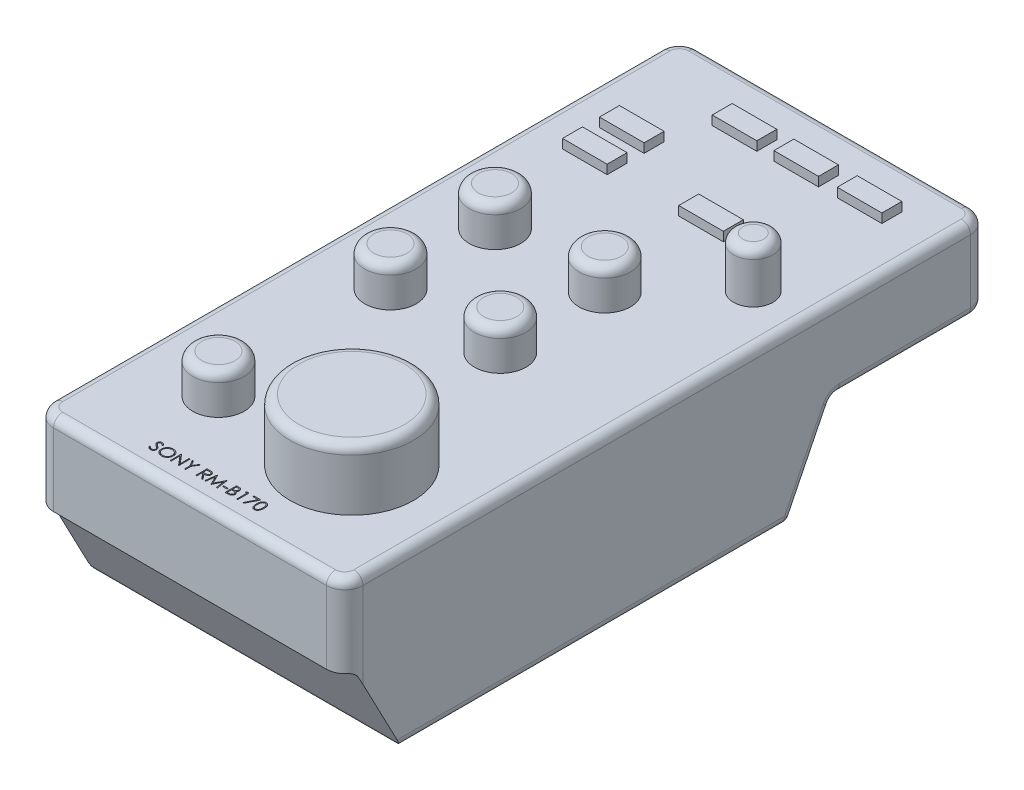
from build123d import *

# Parameters (mm, degrees)
BOSS_EXTRUDE1_DEPTH          = 47
CUT_EXTRUDE1_DEPTH           = 133.722454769
FILLET1_R                    = 2.54
SKETCH3_R                    = 17.1487514
BOSS_EXTRUDE2_DEPTH          = 17
FILLET2_R                    = 2.54
M2_5X0_45_TAPPED_HOLE1_D     = 2.05
M2_5X0_45_TAPPED_HOLE1_DEPTH = 7.2644
M2_5X0_45_TAPPED_HOLE1_TIP   = 0.615882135
SKETCH6_R                    = 7.168230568
BOSS_EXTRUDE3_DEPTH          = 10.922
FILLET3_R                    = 2.54
SKETCH7_R                    = 5.482520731
BOSS_EXTRUDE4_DEPTH          = 13.97
FILLET4_R                    = 2.54
SKETCH8_W                    = 12.400720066
SKETCH8_H                    = 5.547690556
SKETCH8_W_2                  = 12.400720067
BOSS_EXTRUDE5_DEPTH          = 2.54
SKETCH9_W                    = 1.221153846
SKETCH9_H                    = 0.325641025
CUT_EXTRUDE2_DEPTH           = 1.27


with BuildPart() as part:
    # Sketch1 → Boss-Extrude1 (new body)
    with BuildSketch(Plane(origin=(0, 0, 0), x_dir=(1, 0, 0), z_dir=(0, 1, 0))):
        with BuildLine():
            Line((-37.92, 89.5), (37.92, 89.5))
            ThreePointArc((37.92, 89.5), (41.512102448, 88.012102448), (43, 84.42))
            Line((43, 84.42), (43, -84.42))
            ThreePointArc((43, -84.42), (41.512102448, -88.012102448), (37.92, -89.5))
            Line((37.92, -89.5), (-37.92, -89.5))
            ThreePointArc((-37.92, -89.5), (-41.512102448, -88.012102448), (-43, -84.42))
            Line((-43, -84.42), (-43, 84.42))
            ThreePointArc((-43, 84.42), (-41.512102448, 88.012102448), (-37.92, 89.5))
        make_face()
    extrude(amount=BOSS_EXTRUDE1_DEPTH)

    # Sketch2 → Cut-Extrude1 (cut, through all)
    with BuildSketch(Plane(origin=(43, 0, 0), x_dir=(0, 0, -1), z_dir=(1, 0, 0))):
        Polygon((96.291537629, 24.315667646), (46.366008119, 24.315667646), (34.356820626, 0), (34.356820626, -8.083624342), (96.291537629, -8.083624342), align=None)
        Polygon((-100.091843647, 24.315667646), (-86.345531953, 24.315667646), (-73.592412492, 0), (-73.592412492, -10.651398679), (-100.091843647, -10.651398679), align=None)
    extrude(amount=-CUT_EXTRUDE1_DEPTH, mode=Mode.SUBTRACT)

    # Fillet1
    fillet1_edges = [part.edges().sort_by_distance(p)[0] for p in [
        (43, 12.157833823, -40.361414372),
        (-43, 12.157833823, -40.361414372),
        (41.512102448, 47, 88.012102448),
        (0, 47, 89.5),
        (-41.512102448, 47, 88.012102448),
        (-43, 47, 0),
        (-41.512102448, 47, -88.012102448),
        (0, 47, -89.5),
        (41.512102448, 47, -88.012102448),
        (43, 24.315667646, -65.393004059),
        (41.512102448, 24.315667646, -88.012102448),
        (-43, 24.315667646, -65.393004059),
        (-41.512102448, 24.315667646, -88.012102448),
        (43, 47, 0),
        (0, 24.315667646, 86.345531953),
        (-43, 0, 19.617795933),
        (43, 0, 19.617795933),
        (0, 0, 73.592412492),
        (0, 24.315667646, -89.5),
        (0, 24.315667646, -46.366008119),
        (0, 0, -34.356820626),
    ]]
    fillet(fillet1_edges, radius=FILLET1_R)

    # Sketch3 → Boss-Extrude2 (add)
    with BuildSketch(Plane(origin=(0, 47, 0), x_dir=(1, 0, 0), z_dir=(0, 1, 0))):
        with Locations(Location((14.953509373, -59.481737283, 0), (0, 0, 270))):
            Circle(SKETCH3_R)
    extrude(amount=BOSS_EXTRUDE2_DEPTH)

    # Fillet2
    fillet2_edges = [part.edges().sort_by_distance(p)[0] for p in [
        (14.953509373, 64, 42.332985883),
    ]]
    fillet(fillet2_edges, radius=FILLET2_R)

    # M2.5x0.45 Tapped Hole1
    with Locations(Plane(origin=(0, 0, 0), x_dir=(-1, 0, 0), z_dir=(0, -1, 0))):
        with Locations((28, -63.465), (-28, -63.465), (-28, 22.035), (28, 22.035)):
            Hole(M2_5X0_45_TAPPED_HOLE1_D / 2, depth=M2_5X0_45_TAPPED_HOLE1_DEPTH)
            with Locations((0, 0, -(M2_5X0_45_TAPPED_HOLE1_DEPTH + M2_5X0_45_TAPPED_HOLE1_TIP / 2))):  # 118° drill point
                Cone(0, M2_5X0_45_TAPPED_HOLE1_D / 2, M2_5X0_45_TAPPED_HOLE1_TIP, mode=Mode.SUBTRACT)

    # Sketch6 → Boss-Extrude3 (add)
    with BuildSketch(Plane(origin=(0, 47, 0), x_dir=(1, 0, 0), z_dir=(0, 1, 0))):
        with Locations(Location((-20.069586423, -61.514098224, 0), (0, 0, 270))):
            Circle(SKETCH6_R)
        with Locations(Location((-22.027594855, -11.748050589, 0), (0, 0, 270))):
            Circle(SKETCH6_R)
        with Locations(Location((8.484703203, -11.748050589, 0), (0, 0, 270))):
            Circle(SKETCH6_R)
        with Locations(Location((8.484703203, 17.295741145, 0), (0, 0, 270))):
            Circle(SKETCH6_R)
        with Locations(Location((-22.027594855, 17.295741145, 0), (0, 0, 270))):
            Circle(SKETCH6_R)
    extrude(amount=BOSS_EXTRUDE3_DEPTH)

    # Fillet3
    fillet3_edges = [part.edges().sort_by_distance(p)[0] for p in [
        (-20.069586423, 57.922, 54.345867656),
        (-22.027594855, 57.922, 4.579820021),
        (8.484703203, 57.922, 4.579820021),
        (8.484703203, 57.922, -24.463971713),
        (-22.027594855, 57.922, -24.463971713),
    ]]
    fillet(fillet3_edges, radius=FILLET3_R)

    # Sketch7 → Boss-Extrude4 (add)
    with BuildSketch(Plane(origin=(0, 47, 0), x_dir=(1, 0, 0), z_dir=(0, 1, 0))):
        with Locations(Location((28.880624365, 38.181164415, 0), (0, 0, 270))):
            Circle(SKETCH7_R)
    extrude(amount=BOSS_EXTRUDE4_DEPTH)

    # Fillet4
    fillet4_edges = [part.edges().sort_by_distance(p)[0] for p in [
        (28.880624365, 60.97, -43.663685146),
    ]]
    fillet(fillet4_edges, radius=FILLET4_R)

    # Sketch8 → Boss-Extrude5 (add)
    with BuildSketch(Plane(origin=(0, 47, 0), x_dir=(1, 0, 0), z_dir=(0, 1, 0))):
        with Locations((24.311938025, 75.056989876)):
            Rectangle(SKETCH8_W, SKETCH8_H)
        with Locations((6.689862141, 75.056989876)):
            Rectangle(SKETCH8_W, SKETCH8_H)
        with Locations((-10.442711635, 75.056989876)):
            Rectangle(SKETCH8_W, SKETCH8_H)
        with Locations((-25.61727698, 58.903420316)):
            Rectangle(SKETCH8_W_2, SKETCH8_H)
        with Locations((-25.61727698, 48.62387605)):
            Rectangle(SKETCH8_W_2, SKETCH8_H)
        with Locations((6.689862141, 48.62387605)):
            Rectangle(SKETCH8_W, SKETCH8_H)
    extrude(amount=BOSS_EXTRUDE5_DEPTH)

    # Sketch9 → Cut-Extrude2 (cut)
    # profile 1 of 11: a face of its own
    with BuildSketch(Plane(origin=(0, 47, 0), x_dir=(1, 0, 0), z_dir=(0, 1, 0))):
        with BuildLine():
            Line((-17.703832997, -83.092375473), (-17.435433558, -82.931463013))
            add(Edge.make_bspline(
                [(-17.435433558, -82.931463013), (-17.410470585, -82.97324999), (-17.362642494, -83.053312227), (-17.282858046, -83.161496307), (-17.200187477, -83.253446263), (-17.114018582, -83.328627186), (-17.024877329, -83.387817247), (-16.932181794, -83.429729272), (-16.836244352, -83.455869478), (-16.770953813, -83.459044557), (-16.738358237, -83.460629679)],
                knots=[0, 0, 0, 0, 1.272034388, 2.437168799, 3.508375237, 4.49857839, 5.41946034, 6.295179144, 7.148887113, 8, 8, 8, 8], degree=3))
            add(Edge.make_bspline(
                [(-16.738358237, -83.460629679), (-16.710520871, -83.459854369), (-16.655333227, -83.458317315), (-16.574087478, -83.443548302), (-16.495182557, -83.420858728), (-16.420244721, -83.388364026), (-16.350307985, -83.349049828), (-16.288979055, -83.301564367), (-16.235960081, -83.248400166), (-16.192590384, -83.189088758), (-16.159316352, -83.125301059), (-16.133742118, -83.05982716), (-16.119549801, -82.99163853), (-16.117411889, -82.94572761), (-16.116332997, -82.922558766)],
                knots=[0, 0, 0, 0, 1.095163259, 2.171163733, 3.241058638, 4.321873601, 5.38011039, 6.391990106, 7.366004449, 8.327778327, 9.272591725, 10.192022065, 11.087607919, 12, 12, 12, 12], degree=3))
            add(Edge.make_bspline(
                [(-16.116332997, -82.922558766), (-16.117670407, -82.896123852), (-16.120389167, -82.842385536), (-16.143368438, -82.763101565), (-16.179517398, -82.684640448), (-16.212866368, -82.636107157), (-16.230180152, -82.610910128)],
                knots=[0, 0, 0, 0, 0.938893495, 1.908633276, 2.914225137, 4, 4, 4, 4], degree=3))
            add(Edge.make_bspline(
                [(-16.230180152, -82.610910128), (-16.244395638, -82.592724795), (-16.274239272, -82.554546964), (-16.325545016, -82.497718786), (-16.385748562, -82.439100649), (-16.452789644, -82.376454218), (-16.529110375, -82.312693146), (-16.612320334, -82.244776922), (-16.704543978, -82.175288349), (-16.769222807, -82.128686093), (-16.802596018, -82.104640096)],
                knots=[0, 0, 0, 0, 0.722233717, 1.516239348, 2.393582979, 3.351407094, 4.387010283, 5.505090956, 6.712668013, 8, 8, 8, 8], degree=3))
            add(Edge.make_bspline(
                [(-16.802596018, -82.104640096), (-16.836000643, -82.08084702), (-16.899867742, -82.035356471), (-16.989183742, -81.967843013), (-17.069052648, -81.906117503), (-17.13911947, -81.849598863), (-17.19935339, -81.798279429), (-17.250229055, -81.752652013), (-17.290450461, -81.71148264), (-17.312816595, -81.684775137), (-17.322858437, -81.672784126)],
                knots=[0, 0, 0, 0, 1.452282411, 2.77665338, 3.964542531, 5.026858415, 5.96415736, 6.766646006, 7.446254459, 8, 8, 8, 8], degree=3))
            add(Edge.make_bspline(
                [(-17.322858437, -81.672784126), (-17.336894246, -81.654096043), (-17.364497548, -81.617343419), (-17.400933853, -81.559898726), (-17.431902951, -81.501094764), (-17.456180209, -81.440773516), (-17.476623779, -81.37978183), (-17.490374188, -81.317323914), (-17.498984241, -81.253680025), (-17.499865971, -81.210850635), (-17.500307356, -81.189410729)],
                knots=[0, 0, 0, 0, 1.068054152, 2.10047183, 3.106115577, 4.101338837, 5.06977816, 6.043150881, 7.020423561, 8, 8, 8, 8], degree=3))
            add(Edge.make_bspline(
                [(-17.500307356, -81.189410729), (-17.499123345, -81.155819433), (-17.49678063, -81.089354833), (-17.476968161, -80.992262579), (-17.445696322, -80.899564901), (-17.401885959, -80.812179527), (-17.345409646, -80.732381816), (-17.280053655, -80.659253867), (-17.202210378, -80.597778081), (-17.116800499, -80.544064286), (-17.023313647, -80.502021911), (-16.92535047, -80.470307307), (-16.822755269, -80.452337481), (-16.753265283, -80.449758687), (-16.718005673, -80.448450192)],
                knots=[0, 0, 0, 0, 1.005424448, 1.989358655, 2.955360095, 3.929531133, 4.905563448, 5.876582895, 6.856512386, 7.866279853, 8.892233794, 9.918561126, 10.94386622, 12, 12, 12, 12], degree=3))
            add(Edge.make_bspline(
                [(-16.718005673, -80.448450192), (-16.680591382, -80.44974065), (-16.606186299, -80.452306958), (-16.496740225, -80.474620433), (-16.39136586, -80.511541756), (-16.30659947, -80.553441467), (-16.240257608, -80.595289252), (-16.189663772, -80.633407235), (-16.13839437, -80.677290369), (-16.086035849, -80.727055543), (-16.033475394, -80.783159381), (-15.979932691, -80.845217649), (-15.925282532, -80.912851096), (-15.890125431, -80.961133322), (-15.872102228, -80.985885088)],
                knots=[0, 0, 0, 0, 1.286793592, 2.559021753, 3.825965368, 5.121522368, 5.803751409, 6.523245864, 7.299691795, 8.125521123, 9.008227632, 9.944561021, 10.946284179, 12, 12, 12, 12], degree=3))
            Line((-15.872102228, -80.985885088), (-16.129689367, -81.1811425))
            add(Edge.make_bspline(
                [(-16.129689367, -81.1811425), (-16.145243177, -81.161104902), (-16.175196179, -81.122517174), (-16.220670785, -81.06847748), (-16.263532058, -81.01911396), (-16.305759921, -80.976237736), (-16.345124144, -80.937500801), (-16.383330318, -80.904335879), (-16.419828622, -80.876418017), (-16.465836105, -80.846624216), (-16.523637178, -80.817090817), (-16.596194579, -80.792099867), (-16.672019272, -80.777082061), (-16.72366258, -80.775096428), (-16.749806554, -80.774091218)],
                knots=[0, 0, 0, 0, 1.181633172, 2.275549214, 3.290209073, 4.226197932, 5.078386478, 5.862611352, 6.581680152, 7.217281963, 8.414376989, 9.595101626, 10.782541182, 12, 12, 12, 12], degree=3))
            add(Edge.make_bspline(
                [(-16.749806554, -80.774091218), (-16.782605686, -80.775190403), (-16.84585572, -80.777310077), (-16.935654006, -80.80046035), (-17.016474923, -80.836911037), (-17.085919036, -80.887996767), (-17.143737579, -80.948522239), (-17.185561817, -81.018171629), (-17.210735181, -81.09508138), (-17.21380702, -81.148731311), (-17.215371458, -81.176054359)],
                knots=[0, 0, 0, 0, 1.14458467, 2.207223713, 3.21896685, 4.227309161, 5.202851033, 6.127160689, 7.046193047, 8, 8, 8, 8], degree=3))
            add(Edge.make_bspline(
                [(-17.215371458, -81.176054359), (-17.215014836, -81.193064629), (-17.214301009, -81.227112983), (-17.2043453, -81.277415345), (-17.191555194, -81.327590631), (-17.171287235, -81.37741326), (-17.143306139, -81.427754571), (-17.106562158, -81.479481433), (-17.060285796, -81.533049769), (-17.024837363, -81.567890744), (-17.006121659, -81.586285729)],
                knots=[0, 0, 0, 0, 0.858281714, 1.717966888, 2.583508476, 3.4729293, 4.427298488, 5.488583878, 6.674047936, 8, 8, 8, 8], degree=3))
            add(Edge.make_bspline(
                [(-17.006121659, -81.586285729), (-16.999171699, -81.592487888), (-16.982660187, -81.607222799), (-16.952474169, -81.631345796), (-16.912611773, -81.661102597), (-16.864113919, -81.697921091), (-16.806086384, -81.740630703), (-16.738522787, -81.788685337), (-16.662176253, -81.843645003), (-16.607999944, -81.882069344), (-16.57935383, -81.90238649)],
                knots=[0, 0, 0, 0, 0.420754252, 0.999615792, 1.744751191, 2.668019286, 3.750313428, 4.999500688, 6.413464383, 8, 8, 8, 8], degree=3))
            add(Edge.make_bspline(
                [(-16.57935383, -81.90238649), (-16.54489518, -81.927461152), (-16.47817078, -81.97601476), (-16.383231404, -82.048963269), (-16.297149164, -82.120308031), (-16.21962183, -82.189593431), (-16.149883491, -82.256293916), (-16.088707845, -82.321211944), (-16.035471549, -82.383882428), (-15.978158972, -82.464230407), (-15.919595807, -82.56291039), (-15.86930244, -82.683812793), (-15.837590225, -82.805185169), (-15.833443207, -82.886761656), (-15.831397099, -82.927010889)],
                knots=[0, 0, 0, 0, 1.163667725, 2.253281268, 3.268753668, 4.215851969, 5.092017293, 5.902905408, 6.650798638, 7.335211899, 8.59617414, 9.77448103, 10.901945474, 12, 12, 12, 12], degree=3))
            add(Edge.make_bspline(
                [(-15.831397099, -82.927010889), (-15.831993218, -82.955475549), (-15.833173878, -83.011852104), (-15.846745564, -83.094633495), (-15.866629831, -83.175034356), (-15.896599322, -83.252060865), (-15.933178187, -83.327122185), (-15.979593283, -83.398249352), (-16.033393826, -83.467016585), (-16.09511017, -83.531590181), (-16.162643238, -83.590868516), (-16.23402059, -83.643599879), (-16.309359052, -83.687567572), (-16.388249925, -83.723445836), (-16.47071133, -83.751506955), (-16.556715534, -83.771838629), (-16.646404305, -83.784317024), (-16.707364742, -83.785612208), (-16.738358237, -83.786270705)],
                knots=[0, 0, 0, 0, 0.983748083, 1.948392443, 2.894712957, 3.844097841, 4.80183111, 5.778335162, 6.776009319, 7.81870978, 8.863265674, 9.881300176, 10.883814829, 11.87499822, 12.874611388, 13.892143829, 14.928324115, 16, 16, 16, 16], degree=3))
            add(Edge.make_bspline(
                [(-16.738358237, -83.786270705), (-16.76233887, -83.78580699), (-16.809998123, -83.784885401), (-16.880491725, -83.776738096), (-16.949561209, -83.765210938), (-17.01633988, -83.746910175), (-17.081688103, -83.72470606), (-17.145321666, -83.697366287), (-17.207271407, -83.664602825), (-17.2678845, -83.627142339), (-17.327006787, -83.583547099), (-17.384083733, -83.532771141), (-17.440988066, -83.476214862), (-17.496040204, -83.412342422), (-17.550353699, -83.342185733), (-17.602857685, -83.265088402), (-17.654638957, -83.181470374), (-17.687128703, -83.122628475), (-17.703832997, -83.092375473)],
                knots=[0, 0, 0, 0, 0.915332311, 1.819136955, 2.706846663, 3.586547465, 4.459518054, 5.340707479, 6.227863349, 7.133153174, 8.059268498, 9.028702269, 10.047606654, 11.120612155, 12.245963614, 13.433783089, 14.680604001, 16, 16, 16, 16], degree=3))
        make_face()
    # profile 2 of 11: a face of its own
    with BuildSketch(Plane(origin=(0, 47, 0), x_dir=(1, 0, 0), z_dir=(0, 1, 0))):
        with BuildLine():
            add(Edge.make_bspline(
                [(-13.694377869, -80.448450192), (-13.635587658, -80.449939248), (-13.520118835, -80.452863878), (-13.350415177, -80.47525135), (-13.188403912, -80.513982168), (-13.032765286, -80.565565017), (-12.885360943, -80.634375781), (-12.745081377, -80.717547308), (-12.612260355, -80.815950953), (-12.488688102, -80.928826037), (-12.37560644, -81.05163817), (-12.275978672, -81.182700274), (-12.192483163, -81.321219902), (-12.123916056, -81.466780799), (-12.070123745, -81.61905377), (-12.033004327, -81.778850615), (-12.009293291, -81.94513597), (-12.006521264, -82.058553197), (-12.005115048, -82.116088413)],
                knots=[0, 0, 0, 0, 1.065120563, 2.091984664, 3.0946048, 4.079830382, 5.057816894, 6.036188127, 7.030412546, 8.04752943, 9.064399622, 10.05169764, 11.02544977, 11.989514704, 12.962713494, 13.945757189, 14.957906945, 16, 16, 16, 16], degree=3))
            add(Edge.make_bspline(
                [(-12.005115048, -82.116088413), (-12.006521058, -82.173199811), (-12.009292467, -82.285772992), (-12.033031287, -82.451003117), (-12.070261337, -82.609835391), (-12.123416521, -82.762004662), (-12.191656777, -82.907671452), (-12.275708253, -83.046452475), (-12.374714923, -83.178393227), (-12.487388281, -83.302048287), (-12.610216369, -83.41543885), (-12.741960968, -83.51424383), (-12.879659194, -83.599265), (-13.025083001, -83.667104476), (-13.176303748, -83.721326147), (-13.334674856, -83.758294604), (-13.49945423, -83.782140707), (-13.611822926, -83.784878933), (-13.668937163, -83.786270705)],
                knots=[0, 0, 0, 0, 1.043624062, 2.057103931, 3.04512605, 4.022047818, 4.998200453, 5.980619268, 6.982898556, 8.009068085, 9.034988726, 10.034168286, 11.015286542, 11.987931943, 12.962482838, 13.94673481, 14.956375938, 16, 16, 16, 16], degree=3))
            add(Edge.make_bspline(
                [(-13.668937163, -83.786270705), (-13.726472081, -83.78486519), (-13.83988872, -83.782094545), (-14.006383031, -83.758344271), (-14.166292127, -83.721204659), (-14.319158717, -83.668128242), (-14.465068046, -83.599532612), (-14.604305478, -83.515890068), (-14.736312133, -83.416642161), (-14.859993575, -83.30400534), (-14.973158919, -83.181385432), (-15.07181921, -83.050000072), (-15.155480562, -82.912426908), (-15.223845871, -82.768284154), (-15.277970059, -82.618268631), (-15.314895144, -82.461379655), (-15.338785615, -82.298511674), (-15.341538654, -82.187619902), (-15.342935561, -82.131352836)],
                knots=[0, 0, 0, 0, 1.053102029, 2.075944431, 3.073151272, 4.055350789, 5.033113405, 6.020478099, 7.024410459, 8.052272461, 9.079885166, 10.07527673, 11.055994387, 12.023226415, 12.992069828, 13.970394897, 14.97016774, 16, 16, 16, 16], degree=3))
            add(Edge.make_bspline(
                [(-15.342935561, -82.131352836), (-15.34245057, -82.093586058), (-15.341486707, -82.018528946), (-15.329882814, -81.907071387), (-15.3130447, -81.79740629), (-15.288912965, -81.689845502), (-15.257351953, -81.584652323), (-15.220111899, -81.481101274), (-15.174627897, -81.380241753), (-15.123210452, -81.281595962), (-15.065822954, -81.186701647), (-15.002435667, -81.09700374), (-14.935275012, -81.01174955), (-14.861648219, -80.933148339), (-14.783981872, -80.858913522), (-14.701016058, -80.790185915), (-14.613257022, -80.726345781), (-14.520327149, -80.668814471), (-14.424516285, -80.616781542), (-14.325749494, -80.572130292), (-14.225368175, -80.533807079), (-14.122902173, -80.502745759), (-14.018623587, -80.47822384), (-13.912304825, -80.461525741), (-13.804030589, -80.449892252), (-13.731086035, -80.448932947), (-13.694377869, -80.448450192)],
                knots=[0, 0, 0, 0, 1.037015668, 2.060948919, 3.074880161, 4.083647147, 5.086022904, 6.090072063, 7.104153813, 8.122640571, 9.144368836, 10.147691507, 11.138137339, 12.123020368, 13.103399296, 14.087645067, 15.080126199, 16.082011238, 17.087798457, 18.072939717, 19.057185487, 20.037253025, 21.01195951, 21.997135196, 22.992090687, 24, 24, 24, 24], degree=3))
        make_face()
        with BuildLine():
            add(Edge.make_bspline(
                [(-13.680385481, -80.774091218), (-13.710515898, -80.774458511), (-13.770488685, -80.775189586), (-13.8596468, -80.784819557), (-13.94763234, -80.798544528), (-14.034463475, -80.81812205), (-14.119776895, -80.844795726), (-14.204367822, -80.875494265), (-14.287464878, -80.912887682), (-14.368793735, -80.955135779), (-14.447638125, -81.001898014), (-14.522035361, -81.053579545), (-14.592178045, -81.108968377), (-14.657894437, -81.168193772), (-14.718991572, -81.231557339), (-14.77667198, -81.298098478), (-14.828623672, -81.369719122), (-14.876235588, -81.444477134), (-14.918842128, -81.52227514), (-14.956729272, -81.602294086), (-14.987720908, -81.685186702), (-15.012996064, -81.770053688), (-15.033950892, -81.856760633), (-15.047225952, -81.945965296), (-15.056961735, -82.037219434), (-15.057651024, -82.098888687), (-15.057999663, -82.130080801)],
                knots=[0, 0, 0, 0, 1.008559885, 2.007477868, 2.99961109, 3.989939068, 4.984837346, 5.991145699, 7.001802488, 8.033829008, 9.059044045, 10.069351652, 11.065060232, 12.050310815, 13.029377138, 14.011219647, 14.996725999, 15.989392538, 16.977580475, 17.965360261, 18.951710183, 19.937753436, 20.929683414, 21.935841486, 22.955955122, 24, 24, 24, 24], degree=3))
            add(Edge.make_bspline(
                [(-15.057999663, -82.130080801), (-15.056843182, -82.175947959), (-15.054568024, -82.266182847), (-15.034649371, -82.398415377), (-15.003968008, -82.525495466), (-14.958740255, -82.646727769), (-14.90217934, -82.763154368), (-14.832304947, -82.873742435), (-14.749519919, -82.978521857), (-14.655482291, -83.076761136), (-14.552682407, -83.166428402), (-14.443523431, -83.245135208), (-14.329174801, -83.311728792), (-14.209338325, -83.365980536), (-14.084653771, -83.408969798), (-13.954317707, -83.438432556), (-13.819198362, -83.457823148), (-13.727095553, -83.459685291), (-13.680385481, -83.460629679)],
                knots=[0, 0, 0, 0, 1.032063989, 2.030389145, 3.003944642, 3.970395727, 4.937377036, 5.913328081, 6.909231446, 7.93887556, 8.970685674, 9.976071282, 10.964166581, 11.944589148, 12.933237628, 13.927779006, 14.949070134, 16, 16, 16, 16], degree=3))
            add(Edge.make_bspline(
                [(-13.680385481, -83.460629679), (-13.648989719, -83.460198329), (-13.586722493, -83.459342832), (-13.494107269, -83.450726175), (-13.403160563, -83.436908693), (-13.314009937, -83.417014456), (-13.226756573, -83.392115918), (-13.141036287, -83.362536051), (-13.057762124, -83.325632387), (-12.975883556, -83.284858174), (-12.897509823, -83.238376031), (-12.822692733, -83.188448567), (-12.753318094, -83.133141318), (-12.687650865, -83.074795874), (-12.62630289, -83.012235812), (-12.569689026, -82.945542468), (-12.517999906, -82.874294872), (-12.470406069, -82.799650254), (-12.427948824, -82.721639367), (-12.390956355, -82.641330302), (-12.359572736, -82.55892081), (-12.334237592, -82.474292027), (-12.314384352, -82.387604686), (-12.30070471, -82.298742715), (-12.29113577, -82.207883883), (-12.290414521, -82.146430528), (-12.290050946, -82.115452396)],
                knots=[0, 0, 0, 0, 1.047197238, 2.076906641, 3.100256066, 4.114471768, 5.12198147, 6.126382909, 7.136867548, 8.15857795, 9.17633901, 10.174870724, 11.156907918, 12.133735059, 13.104061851, 14.077631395, 15.04955518, 16.038496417, 17.029181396, 18.010275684, 18.986308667, 19.968651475, 20.955262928, 21.950658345, 22.966943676, 24, 24, 24, 24], degree=3))
            add(Edge.make_bspline(
                [(-12.290050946, -82.115452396), (-12.290414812, -82.084686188), (-12.291136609, -82.023655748), (-12.30070014, -81.933430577), (-12.314398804, -81.845208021), (-12.33414069, -81.759334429), (-12.359586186, -81.675787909), (-12.390961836, -81.594646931), (-12.427959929, -81.515609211), (-12.470421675, -81.438870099), (-12.518151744, -81.365233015), (-12.570307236, -81.294836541), (-12.627788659, -81.229002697), (-12.688953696, -81.166106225), (-12.755330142, -81.107488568), (-12.826617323, -81.053130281), (-12.901949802, -81.001719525), (-12.981712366, -80.955341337), (-13.064030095, -80.912511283), (-13.148497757, -80.875816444), (-13.23415844, -80.844636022), (-13.320794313, -80.818041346), (-13.409134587, -80.798621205), (-13.498582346, -80.784807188), (-13.589013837, -80.775192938), (-13.649831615, -80.774459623), (-13.680385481, -80.774091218)],
                knots=[0, 0, 0, 0, 1.02996197, 2.043119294, 3.035359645, 4.018872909, 4.991431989, 5.957985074, 6.929999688, 7.912076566, 8.892894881, 9.867085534, 10.843653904, 11.817741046, 12.803660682, 13.806313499, 14.818574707, 15.856120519, 16.894564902, 17.924820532, 18.937903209, 19.946497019, 20.957711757, 21.963978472, 22.977135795, 24, 24, 24, 24], degree=3))
        make_face(mode=Mode.SUBTRACT)
    # profile 3 of 11: a face of its own
    with BuildSketch(Plane(origin=(0, 47, 0), x_dir=(1, 0, 0), z_dir=(0, 1, 0))):
        Polygon((-11.353832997, -83.704860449), (-11.353832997, -80.529860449), (-11.29404734, -80.529860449), (-9.196461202, -83.02877371), (-9.196461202, -80.529860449), (-8.911525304, -80.529860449), (-8.911525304, -83.704860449), (-8.976399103, -83.704860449), (-11.068897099, -81.211671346), (-11.068897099, -83.704860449), align=None)
    # profile 4 of 11: a face of its own
    with BuildSketch(Plane(origin=(0, 47, 0), x_dir=(1, 0, 0), z_dir=(0, 1, 0))):
        Polygon((-8.34165351, -80.529860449), (-8.015376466, -80.529860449), (-7.180921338, -81.894118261), (-6.347738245, -80.529860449), (-6.021461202, -80.529860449), (-7.039089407, -82.195590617), (-7.039089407, -83.704860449), (-7.324025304, -83.704860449), (-7.324025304, -82.195590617), align=None)
    # profile 5 of 11: a face of its own
    with BuildSketch(Plane(origin=(0, 47, 0), x_dir=(1, 0, 0), z_dir=(0, 1, 0))):
        with BuildLine():
            Line((-4.230435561, -80.529860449), (-3.59505395, -80.529860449))
            add(Edge.make_bspline(
                [(-3.59505395, -80.529860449), (-3.552653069, -80.530001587), (-3.471238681, -80.530272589), (-3.354604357, -80.531783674), (-3.248625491, -80.536114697), (-3.153357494, -80.539841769), (-3.068802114, -80.54663803), (-2.994700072, -80.55313376), (-2.93139266, -80.561637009), (-2.893069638, -80.569534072), (-2.875718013, -80.573109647)],
                knots=[0, 0, 0, 0, 1.410062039, 2.707475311, 3.878576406, 4.937260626, 5.877586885, 6.699081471, 7.410979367, 8, 8, 8, 8], degree=3))
            add(Edge.make_bspline(
                [(-2.875718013, -80.573109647), (-2.852489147, -80.578848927), (-2.806526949, -80.590205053), (-2.740350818, -80.614207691), (-2.677291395, -80.641984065), (-2.617610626, -80.674608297), (-2.561607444, -80.712322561), (-2.508704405, -80.754475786), (-2.458661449, -80.800837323), (-2.413502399, -80.852576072), (-2.370921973, -80.906856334), (-2.335009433, -80.965551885), (-2.304051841, -81.026930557), (-2.279404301, -81.091616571), (-2.259557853, -81.158982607), (-2.24556405, -81.229638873), (-2.237171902, -81.303263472), (-2.236317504, -81.353481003), (-2.235884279, -81.378943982)],
                knots=[0, 0, 0, 0, 1.027469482, 2.033020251, 3.019912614, 3.986113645, 4.951240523, 5.91722682, 6.890402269, 7.87763091, 8.8651537, 9.85103654, 10.82876324, 11.815024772, 12.821070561, 13.842952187, 14.906261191, 16, 16, 16, 16], degree=3))
            add(Edge.make_bspline(
                [(-2.235884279, -81.378943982), (-2.23721687, -81.421248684), (-2.2398171, -81.503796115), (-2.264060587, -81.6235942), (-2.303772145, -81.735344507), (-2.358493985, -81.838906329), (-2.428180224, -81.932260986), (-2.511931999, -82.014258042), (-2.609796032, -82.082874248), (-2.700899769, -82.130456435), (-2.781376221, -82.160930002), (-2.847627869, -82.182371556), (-2.919897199, -82.198937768), (-2.997491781, -82.213778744), (-3.080734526, -82.224983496), (-3.169425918, -82.233190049), (-3.263629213, -82.238319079), (-3.32834394, -82.239082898), (-3.361635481, -82.239475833)],
                knots=[0, 0, 0, 0, 1.260483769, 2.459530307, 3.627416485, 4.787058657, 5.939039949, 7.08810263, 8.267026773, 9.491475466, 10.141966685, 10.831826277, 11.566392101, 12.351337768, 13.187381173, 14.07005841, 15.007169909, 16, 16, 16, 16], degree=3))
            Line((-3.361635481, -82.239475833), (-2.195179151, -83.704860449))
            Line((-2.195179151, -83.704860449), (-2.547532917, -83.704860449))
            Line((-2.547532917, -83.704860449), (-3.713989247, -82.239475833))
            Line((-3.713989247, -82.239475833), (-3.945499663, -82.239475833))
            Line((-3.945499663, -82.239475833), (-3.945499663, -83.704860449))
            Line((-3.945499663, -83.704860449), (-4.230435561, -83.704860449))
            Line((-4.230435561, -83.704860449), (-4.230435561, -80.529860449))
        make_face()
        with BuildLine():
            Line((-3.945499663, -80.855501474), (-3.945499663, -81.913834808))
            Line((-3.945499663, -81.913834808), (-3.364179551, -81.918286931))
            add(Edge.make_bspline(
                [(-3.364179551, -81.918286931), (-3.337037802, -81.918298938), (-3.284429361, -81.918322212), (-3.208319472, -81.914699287), (-3.13745337, -81.910577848), (-3.072102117, -81.904273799), (-3.012236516, -81.896149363), (-2.957886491, -81.885986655), (-2.908963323, -81.87414657), (-2.851905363, -81.855820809), (-2.788190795, -81.826786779), (-2.718947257, -81.784545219), (-2.65998085, -81.731414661), (-2.610162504, -81.670660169), (-2.570130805, -81.603861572), (-2.541907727, -81.531819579), (-2.523998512, -81.456352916), (-2.521886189, -81.404484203), (-2.520820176, -81.378307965)],
                knots=[0, 0, 0, 0, 1.146690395, 2.22261258, 3.21895312, 4.145990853, 4.996080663, 5.770904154, 6.481378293, 7.121626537, 8.300444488, 9.431385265, 10.535395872, 11.636531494, 12.74115979, 13.810798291, 14.895190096, 16, 16, 16, 16], degree=3))
            add(Edge.make_bspline(
                [(-2.520820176, -81.378307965), (-2.521910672, -81.352775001), (-2.524071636, -81.302177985), (-2.541714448, -81.228104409), (-2.571549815, -81.158193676), (-2.611756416, -81.092730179), (-2.660741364, -81.033307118), (-2.718179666, -80.982464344), (-2.782500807, -80.940509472), (-2.842618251, -80.913699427), (-2.896352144, -80.897262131), (-2.943006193, -80.885695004), (-2.995721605, -80.876401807), (-3.054754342, -80.868955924), (-3.119852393, -80.862556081), (-3.191344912, -80.858245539), (-3.268757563, -80.855692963), (-3.322412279, -80.855566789), (-3.350187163, -80.855501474)],
                knots=[0, 0, 0, 0, 1.101028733, 2.181837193, 3.264309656, 4.369019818, 5.486613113, 6.575447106, 7.666700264, 8.788928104, 9.402425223, 10.0903467, 10.862060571, 11.710948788, 12.657782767, 13.684531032, 14.801375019, 16, 16, 16, 16], degree=3))
            Line((-3.350187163, -80.855501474), (-3.945499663, -80.855501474))
        make_face(mode=Mode.SUBTRACT)
    # profile 6 of 11: a face of its own
    with BuildSketch(Plane(origin=(0, 47, 0), x_dir=(1, 0, 0), z_dir=(0, 1, 0))):
        Polygon((-1.706717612, -83.704860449), (-1.287581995, -80.529860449), (-1.246876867, -80.529860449), (0.063955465, -83.134988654), (1.371607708, -80.529860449), (1.412948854, -80.529860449), (1.834628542, -83.704860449), (1.548420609, -83.704860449), (1.244404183, -81.420285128), (0.098300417, -83.704860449), (0.034062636, -83.704860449), (-1.116493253, -81.415196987), (-1.419873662, -83.704860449), align=None)
    # profile 7 of 11: a face of its own
    with BuildSketch(Plane(origin=(0, 47, 0), x_dir=(1, 0, 0), z_dir=(0, 1, 0))):
        with Locations((2.811551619, -82.483706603)):
            Rectangle(SKETCH9_W, SKETCH9_H)
    # profile 8 of 11: a face of its own
    with BuildSketch(Plane(origin=(0, 47, 0), x_dir=(1, 0, 0), z_dir=(0, 1, 0))):
        with BuildLine():
            Line((3.951295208, -80.529860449), (4.570776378, -80.529860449))
            add(Edge.make_bspline(
                [(4.570776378, -80.529860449), (4.601100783, -80.530019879), (4.659877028, -80.530328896), (4.745347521, -80.53512145), (4.8254018, -80.541656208), (4.900063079, -80.552024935), (4.969296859, -80.564536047), (5.033311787, -80.57968698), (5.0919043, -80.59785398), (5.161856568, -80.626743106), (5.241613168, -80.66967198), (5.32797171, -80.733107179), (5.401816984, -80.810697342), (5.465486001, -80.898220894), (5.516105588, -80.994501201), (5.552726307, -81.097243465), (5.575910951, -81.205122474), (5.578295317, -81.279184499), (5.579500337, -81.316614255)],
                knots=[0, 0, 0, 0, 1.001505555, 1.941167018, 2.826882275, 3.653841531, 4.429895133, 5.150066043, 5.825578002, 6.45369114, 7.647487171, 8.808567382, 9.977351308, 11.170798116, 12.373658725, 13.556498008, 14.765093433, 16, 16, 16, 16], degree=3))
            add(Edge.make_bspline(
                [(5.579500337, -81.316614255), (5.578508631, -81.351677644), (5.576559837, -81.420580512), (5.557924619, -81.52135874), (5.528750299, -81.617290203), (5.488196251, -81.708024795), (5.43548944, -81.79151243), (5.373025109, -81.868426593), (5.297662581, -81.935510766), (5.24119907, -81.973014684), (5.212518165, -81.992064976)],
                knots=[0, 0, 0, 0, 1.044552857, 2.05264487, 3.044412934, 4.028983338, 5.005914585, 5.980388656, 6.974128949, 8, 8, 8, 8], degree=3))
            add(Edge.make_bspline(
                [(5.212518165, -81.992064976), (5.248586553, -82.005912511), (5.317594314, -82.032406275), (5.412559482, -82.079247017), (5.494379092, -82.130194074), (5.563682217, -82.185830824), (5.622952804, -82.24580096), (5.674707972, -82.310983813), (5.718868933, -82.382229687), (5.756708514, -82.458795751), (5.786234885, -82.53990019), (5.808347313, -82.624782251), (5.821017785, -82.713137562), (5.822820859, -82.77326787), (5.823731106, -82.803623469)],
                knots=[0, 0, 0, 0, 1.27268992, 2.434971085, 3.483601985, 4.442670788, 5.356604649, 6.2567628, 7.179492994, 8.113709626, 9.066344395, 10.018646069, 10.999752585, 12, 12, 12, 12], degree=3))
            add(Edge.make_bspline(
                [(5.823731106, -82.803623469), (5.822844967, -82.834617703), (5.821101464, -82.895599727), (5.808238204, -82.985184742), (5.786458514, -83.070796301), (5.75645826, -83.152988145), (5.717303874, -83.231601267), (5.669653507, -83.306724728), (5.612837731, -83.377603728), (5.5492807, -83.445025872), (5.477378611, -83.505648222), (5.399803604, -83.55963747), (5.315578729, -83.60403854), (5.226087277, -83.641336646), (5.130325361, -83.669827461), (5.028722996, -83.689759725), (4.921367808, -83.703190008), (4.847698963, -83.704294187), (4.809919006, -83.704860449)],
                knots=[0, 0, 0, 0, 0.978564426, 1.925352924, 2.850884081, 3.763762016, 4.682927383, 5.618979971, 6.567305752, 7.547517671, 8.540179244, 9.531824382, 10.526200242, 11.540722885, 12.589160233, 13.674978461, 14.80764778, 16, 16, 16, 16], degree=3))
            Line((4.809919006, -83.704860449), (3.951295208, -83.704860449))
            Line((3.951295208, -83.704860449), (3.951295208, -80.529860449))
        make_face()
        with BuildLine():
            Line((4.236231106, -80.855501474), (4.236231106, -81.873129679))
            Line((4.236231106, -81.873129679), (4.427672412, -81.873129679))
            add(Edge.make_bspline(
                [(4.427672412, -81.873129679), (4.455656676, -81.872766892), (4.509727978, -81.872065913), (4.588032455, -81.870057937), (4.660717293, -81.864435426), (4.727657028, -81.858814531), (4.788746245, -81.849675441), (4.843849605, -81.838796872), (4.893831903, -81.827291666), (4.951471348, -81.80772506), (5.016851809, -81.778807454), (5.08655041, -81.733929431), (5.147995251, -81.680476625), (5.199881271, -81.61879911), (5.242345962, -81.550884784), (5.271840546, -81.477817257), (5.291840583, -81.401417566), (5.293647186, -81.348968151), (5.294564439, -81.322338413)],
                knots=[0, 0, 0, 0, 1.156816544, 2.235205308, 3.236616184, 4.169592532, 5.011045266, 5.787822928, 6.49130361, 7.128639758, 8.301311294, 9.436451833, 10.541879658, 11.654887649, 12.756523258, 13.837046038, 14.901820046, 16, 16, 16, 16], degree=3))
            add(Edge.make_bspline(
                [(5.294564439, -81.322338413), (5.294087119, -81.304716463), (5.293150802, -81.270149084), (5.285482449, -81.219757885), (5.272449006, -81.172365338), (5.255708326, -81.127321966), (5.232314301, -81.086036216), (5.204770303, -81.047080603), (5.171491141, -81.011781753), (5.133611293, -80.978789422), (5.090060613, -80.949539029), (5.040865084, -80.923920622), (4.98535912, -80.903291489), (4.924478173, -80.885224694), (4.857285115, -80.872535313), (4.784555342, -80.861964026), (4.705693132, -80.856582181), (4.651132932, -80.855869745), (4.622929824, -80.855501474)],
                knots=[0, 0, 0, 0, 0.91205012, 1.789085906, 2.630437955, 3.453916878, 4.269457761, 5.079663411, 5.91843418, 6.774407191, 7.675494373, 8.627863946, 9.638891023, 10.736472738, 11.911756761, 13.175263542, 14.539845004, 16, 16, 16, 16], degree=3))
            Line((4.622929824, -80.855501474), (4.236231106, -80.855501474))
        make_face(mode=Mode.SUBTRACT)
        with BuildLine():
            Line((4.236231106, -82.198770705), (4.236231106, -83.379219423))
            Line((4.236231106, -83.379219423), (4.642010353, -83.379219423))
            add(Edge.make_bspline(
                [(4.642010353, -83.379219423), (4.671056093, -83.378871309), (4.727037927, -83.378200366), (4.807865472, -83.37601002), (4.882780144, -83.371027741), (4.951440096, -83.363184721), (5.014586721, -83.354677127), (5.071462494, -83.343236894), (5.122528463, -83.330129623), (5.181741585, -83.309869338), (5.248419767, -83.278394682), (5.32027533, -83.230938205), (5.384161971, -83.174402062), (5.438413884, -83.108969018), (5.482875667, -83.0378206), (5.515220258, -82.96239589), (5.535169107, -82.883941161), (5.537584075, -82.830449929), (5.538795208, -82.803623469)],
                knots=[0, 0, 0, 0, 1.160039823, 2.235823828, 3.228722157, 4.157150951, 4.99529583, 5.772374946, 6.472645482, 7.099169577, 8.269452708, 9.405989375, 10.527446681, 11.663510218, 12.788923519, 13.866172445, 14.929861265, 16, 16, 16, 16], degree=3))
            add(Edge.make_bspline(
                [(5.538795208, -82.803623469), (5.538544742, -82.786847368), (5.53804785, -82.753565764), (5.530554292, -82.704656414), (5.519655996, -82.657280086), (5.505566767, -82.611308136), (5.485047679, -82.567571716), (5.46109317, -82.525205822), (5.433006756, -82.484154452), (5.389242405, -82.432254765), (5.325586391, -82.372458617), (5.235138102, -82.313913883), (5.132293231, -82.266699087), (5.057701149, -82.246651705), (5.019168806, -82.236295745)],
                knots=[0, 0, 0, 0, 0.723448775, 1.435228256, 2.130040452, 2.821711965, 3.505591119, 4.210454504, 4.921174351, 5.648778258, 7.137944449, 8.670945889, 10.280296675, 12, 12, 12, 12], degree=3))
            add(Edge.make_bspline(
                [(5.019168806, -82.236295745), (5.003720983, -82.23316149), (4.970226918, -82.22636578), (4.915610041, -82.219192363), (4.853256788, -82.212801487), (4.783023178, -82.208074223), (4.704820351, -82.203187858), (4.618481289, -82.201287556), (4.524358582, -82.19902037), (4.459051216, -82.198856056), (4.425128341, -82.198770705)],
                knots=[0, 0, 0, 0, 0.634451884, 1.375622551, 2.216452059, 3.157844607, 4.20941857, 5.370758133, 6.634282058, 8, 8, 8, 8], degree=3))
            Line((4.425128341, -82.198770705), (4.236231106, -82.198770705))
        make_face(mode=Mode.SUBTRACT)
    # profile 9 of 11: a face of its own
    with BuildSketch(Plane(origin=(0, 47, 0), x_dir=(1, 0, 0), z_dir=(0, 1, 0))):
        Polygon((6.864891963, -80.529860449), (7.451936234, -80.529860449), (7.451936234, -83.704860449), (7.167000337, -83.704860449), (7.167000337, -80.855501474), (6.678538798, -80.855501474), align=None)
    # profile 10 of 11: a face of its own
    with BuildSketch(Plane(origin=(0, 47, 0), x_dir=(1, 0, 0), z_dir=(0, 1, 0))):
        Polygon((8.835910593, -80.529860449), (10.789756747, -80.529860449), (9.12084649, -83.786270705), (8.874707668, -83.65079895), (10.307655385, -80.855501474), (8.835910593, -80.855501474), align=None)
    # profile 11 of 11: a face of its own
    with BuildSketch(Plane(origin=(0, 47, 0), x_dir=(1, 0, 0), z_dir=(0, 1, 0))):
        with BuildLine():
            add(Edge.make_bspline(
                [(11.074692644, -82.118632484), (11.074990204, -82.067744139), (11.075568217, -81.968892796), (11.081998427, -81.824852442), (11.092680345, -81.68972418), (11.107319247, -81.563501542), (11.125133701, -81.446151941), (11.148914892, -81.337988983), (11.175959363, -81.238512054), (11.207303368, -81.147396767), (11.242670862, -81.063415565), (11.281164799, -80.985015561), (11.324312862, -80.91231538), (11.369649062, -80.84415467), (11.419008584, -80.781649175), (11.470986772, -80.723916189), (11.527612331, -80.672290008), (11.586960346, -80.625258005), (11.649568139, -80.584028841), (11.713651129, -80.547713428), (11.779650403, -80.516689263), (11.847746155, -80.492295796), (11.917326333, -80.472147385), (11.988634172, -80.45836884), (12.061787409, -80.449699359), (12.111164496, -80.448870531), (12.136206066, -80.448450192)],
                knots=[0, 0, 0, 0, 1.646270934, 3.197905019, 4.663502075, 6.030701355, 7.308322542, 8.50163776, 9.611534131, 10.641858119, 11.616356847, 12.558055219, 13.465016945, 14.349605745, 15.204443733, 16.039544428, 16.859896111, 17.680448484, 18.487036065, 19.28249412, 20.06191084, 20.843045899, 21.620316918, 22.403196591, 23.190181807, 24, 24, 24, 24], degree=3))
            add(Edge.make_bspline(
                [(12.136206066, -80.448450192), (12.161456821, -80.44889271), (12.211672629, -80.449772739), (12.285913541, -80.458230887), (12.358439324, -80.472265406), (12.428940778, -80.492150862), (12.497997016, -80.516821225), (12.5650679, -80.54774311), (12.630570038, -80.583737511), (12.693462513, -80.626032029), (12.754435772, -80.673187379), (12.811992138, -80.726493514), (12.866136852, -80.785412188), (12.91754945, -80.849313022), (12.964771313, -80.919421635), (13.009741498, -80.994518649), (13.049993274, -81.075917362), (13.088759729, -81.162259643), (13.122221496, -81.255934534), (13.152398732, -81.356413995), (13.176781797, -81.464884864), (13.197092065, -81.58077803), (13.212826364, -81.704519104), (13.224285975, -81.835842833), (13.230339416, -81.974835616), (13.231479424, -82.069865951), (13.232064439, -82.118632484)],
                knots=[0, 0, 0, 0, 0.810914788, 1.612654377, 2.396697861, 3.181598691, 3.963628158, 4.749916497, 5.551656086, 6.361998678, 7.18212741, 8.025565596, 8.878627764, 9.750805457, 10.657531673, 11.591944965, 12.560506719, 13.57287815, 14.630710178, 15.753379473, 16.941251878, 18.199788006, 19.531962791, 20.947069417, 22.433333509, 24, 24, 24, 24], degree=3))
            add(Edge.make_bspline(
                [(13.232064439, -82.118632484), (13.231473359, -82.167186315), (13.230321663, -82.261791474), (13.224353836, -82.400158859), (13.212598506, -82.530785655), (13.197893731, -82.653985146), (13.177527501, -82.769244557), (13.152485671, -82.876962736), (13.12468145, -82.977604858), (13.090359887, -83.070346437), (13.052794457, -83.156481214), (13.011922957, -83.236914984), (12.968135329, -83.312358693), (12.920429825, -83.382208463), (12.869581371, -83.446959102), (12.814501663, -83.50546766), (12.756743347, -83.559143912), (12.695590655, -83.60690646), (12.631717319, -83.648711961), (12.566440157, -83.686098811), (12.498600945, -83.716245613), (12.429737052, -83.742130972), (12.358863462, -83.761907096), (12.286068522, -83.775581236), (12.211722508, -83.785171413), (12.161465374, -83.785903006), (12.136206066, -83.786270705)],
                knots=[0, 0, 0, 0, 1.561518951, 3.042555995, 4.452378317, 5.7783523, 7.031515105, 8.214008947, 9.334062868, 10.386615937, 11.391082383, 12.354592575, 13.286541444, 14.194233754, 15.072674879, 15.931287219, 16.775624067, 17.606195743, 18.42308326, 19.229000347, 20.022332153, 20.807536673, 21.593273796, 22.3848459, 23.188221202, 24, 24, 24, 24], degree=3))
            add(Edge.make_bspline(
                [(12.136206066, -83.786270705), (12.111165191, -83.785847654), (12.061789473, -83.78501348), (11.988626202, -83.776383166), (11.917612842, -83.76250796), (11.848398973, -83.74308004), (11.780629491, -83.719299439), (11.71522786, -83.688317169), (11.651466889, -83.652635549), (11.589516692, -83.611999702), (11.530541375, -83.565443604), (11.474209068, -83.513950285), (11.421934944, -83.456234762), (11.373281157, -83.39320836), (11.327040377, -83.325450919), (11.284505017, -83.252037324), (11.245161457, -83.17325867), (11.209199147, -83.088605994), (11.177314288, -82.996844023), (11.149149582, -82.896922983), (11.126911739, -82.787960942), (11.107877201, -82.670833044), (11.092524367, -82.545035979), (11.082042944, -82.410501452), (11.075564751, -82.267313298), (11.074988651, -82.169097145), (11.074692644, -82.118632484)],
                knots=[0, 0, 0, 0, 0.810891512, 1.598919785, 2.382837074, 3.152667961, 3.926044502, 4.706494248, 5.493654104, 6.291793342, 7.103789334, 7.925228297, 8.761435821, 9.622817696, 10.50288917, 11.416980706, 12.369136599, 13.353924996, 14.394355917, 15.514179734, 16.714354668, 17.994756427, 19.357759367, 20.818452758, 22.365282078, 24, 24, 24, 24], degree=3))
        make_face()
        with BuildLine():
            add(Edge.make_bspline(
                [(11.359628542, -82.117360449), (11.359736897, -82.159768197), (11.359947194, -82.242073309), (11.365441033, -82.361673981), (11.372925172, -82.473225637), (11.382578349, -82.576869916), (11.396913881, -82.672255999), (11.412976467, -82.760039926), (11.432523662, -82.839757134), (11.455651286, -82.911954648), (11.481993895, -82.977857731), (11.510755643, -83.039181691), (11.541653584, -83.096650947), (11.5762331, -83.149749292), (11.613893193, -83.198649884), (11.653783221, -83.244218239), (11.697391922, -83.2848555), (11.757720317, -83.333593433), (11.837364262, -83.383957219), (11.937712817, -83.427814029), (12.040826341, -83.455375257), (12.110813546, -83.458880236), (12.14574633, -83.460629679)],
                knots=[0, 0, 0, 0, 1.459021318, 2.831673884, 4.118529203, 5.306027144, 6.411944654, 7.436330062, 8.375795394, 9.233974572, 10.042671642, 10.816086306, 11.563610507, 12.285937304, 12.993564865, 13.685989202, 14.367179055, 15.041617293, 16.353048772, 17.594441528, 18.799311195, 20, 20, 20, 20], degree=3))
            add(Edge.make_bspline(
                [(12.14574633, -83.460629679), (12.180905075, -83.459180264), (12.251149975, -83.456284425), (12.35377849, -83.428345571), (12.453410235, -83.38619106), (12.53148978, -83.336345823), (12.590891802, -83.288876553), (12.633452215, -83.248404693), (12.672515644, -83.203087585), (12.709565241, -83.154193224), (12.743545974, -83.10078747), (12.774446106, -83.043127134), (12.802643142, -82.981052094), (12.818707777, -82.937718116), (12.82692121, -82.915562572)],
                knots=[0, 0, 0, 0, 1.353760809, 2.704726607, 4.075137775, 5.516104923, 6.260822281, 7.007110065, 7.778089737, 8.566572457, 9.372053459, 10.217411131, 11.088608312, 12, 12, 12, 12], degree=3))
            add(Edge.make_bspline(
                [(12.82692121, -82.915562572), (12.836493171, -82.887232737), (12.855928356, -82.829711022), (12.88097618, -82.740481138), (12.900702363, -82.646861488), (12.918449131, -82.54941156), (12.93056226, -82.447412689), (12.940312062, -82.341180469), (12.9460549, -82.230634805), (12.946766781, -82.15552792), (12.947128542, -82.117360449)],
                knots=[0, 0, 0, 0, 0.884706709, 1.796334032, 2.740027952, 3.714592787, 4.726048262, 5.777819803, 6.87074269, 8, 8, 8, 8], degree=3))
            add(Edge.make_bspline(
                [(12.947128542, -82.117360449), (12.946629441, -82.079199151), (12.945653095, -82.004547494), (12.94192112, -81.895220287), (12.93228402, -81.791381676), (12.921580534, -81.692584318), (12.905798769, -81.599375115), (12.888782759, -81.510973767), (12.865921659, -81.428475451), (12.841501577, -81.350588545), (12.813552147, -81.278197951), (12.782785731, -81.210966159), (12.749927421, -81.148568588), (12.714238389, -81.091176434), (12.676142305, -81.038532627), (12.634633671, -80.991692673), (12.59135899, -80.949204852), (12.530746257, -80.900706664), (12.45139458, -80.851256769), (12.352656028, -80.805749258), (12.249903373, -80.779616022), (12.180440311, -80.775931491), (12.14574633, -80.774091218)],
                knots=[0, 0, 0, 0, 1.31362396, 2.569729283, 3.763502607, 4.902122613, 5.988968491, 7.01645872, 7.998833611, 8.933434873, 9.825090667, 10.667526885, 11.477055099, 12.250526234, 12.991942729, 13.710640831, 14.402115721, 15.076753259, 16.378508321, 17.609869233, 18.806226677, 20, 20, 20, 20], degree=3))
            add(Edge.make_bspline(
                [(12.14574633, -80.774091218), (12.110630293, -80.77593403), (12.040334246, -80.779623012), (11.936513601, -80.805651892), (11.836996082, -80.851020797), (11.757854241, -80.900870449), (11.697199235, -80.948348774), (11.654488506, -80.989520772), (11.614441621, -81.034557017), (11.577550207, -81.083907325), (11.542997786, -81.136943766), (11.51126501, -81.194083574), (11.48267429, -81.255616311), (11.45629046, -81.321489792), (11.433092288, -81.393681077), (11.41395705, -81.473300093), (11.396279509, -81.560804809), (11.38376523, -81.656707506), (11.372640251, -81.760377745), (11.365490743, -81.872207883), (11.359928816, -81.992009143), (11.359730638, -82.074739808), (11.359628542, -82.117360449)],
                knots=[0, 0, 0, 0, 1.207732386, 2.417664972, 3.655092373, 4.956220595, 5.625982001, 6.301752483, 6.994047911, 7.697131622, 8.419323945, 9.170223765, 9.943494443, 10.752040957, 11.610060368, 12.549350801, 13.567764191, 14.679664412, 15.874934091, 17.154273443, 18.533957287, 20, 20, 20, 20], degree=3))
        make_face(mode=Mode.SUBTRACT)
    extrude(amount=-CUT_EXTRUDE2_DEPTH, mode=Mode.SUBTRACT)


solid = part.part
